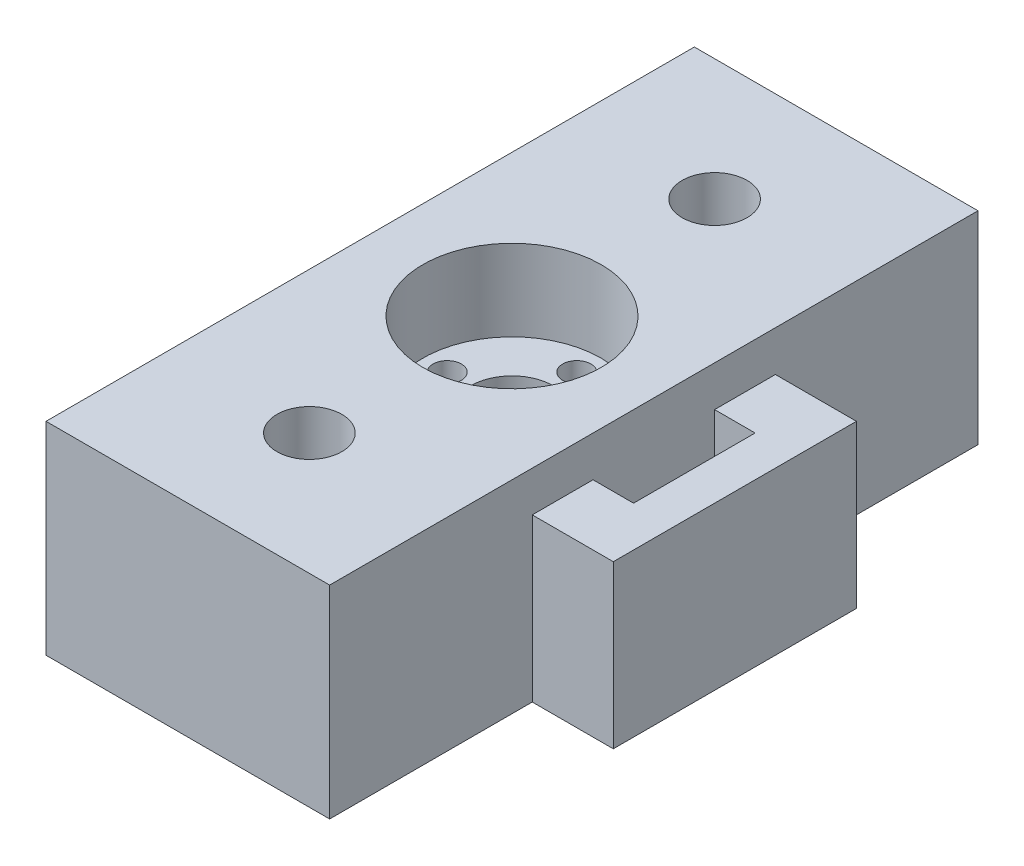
from build123d import *

# Parameters (mm, degrees)
SKETCH1_W           = 80
SKETCH1_H           = 25
BOSS_EXTRUDE1_DEPTH = 35
SKETCH2_3_R         = 11
SKETCH2_3_R_2       = 5.1
CUT_EXTRUDE2_DEPTH  = 10
SKETCH2_R           = 5.1
CUT_EXTRUDE3_DEPTH  = 91.829510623
SKETCH5_R           = 4
CUT_EXTRUDE4_DEPTH  = 91.829510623
SKETCH6_R           = 1.75
CUT_EXTRUDE5_DEPTH  = 10
SKETCH7_W           = 7.5
SKETCH7_H           = 20
BOSS_EXTRUDE2_DEPTH = 10
BOSS_EXTRUDE3_START = 10
SKETCH7_3_W         = 15
SKETCH7_3_H         = 20
BOSS_EXTRUDE3_DEPTH = 5


with BuildPart() as part:
    # Sketch1 → Boss-Extrude1 (new body)
    with BuildSketch(Plane(origin=(0, 0, 0), x_dir=(0, 0, -1), z_dir=(1, 0, 0))):
        with Locations((-40, 12.5)):
            Rectangle(SKETCH1_W, SKETCH1_H)
    extrude(amount=BOSS_EXTRUDE1_DEPTH)

    # Sketch2_3 → Cut-Extrude2 (cut)
    with BuildSketch(Plane(origin=(0, 25, 0), x_dir=(1, 0, 0), z_dir=(0, 1, 0))):
        with Locations(Location((17.5, -40, 0), (0, 0, 90))):
            Circle(SKETCH2_3_R)
        with Locations(Location((17.5, -40, 0), (0, 0, 90))):
            Circle(SKETCH2_3_R_2, mode=Mode.SUBTRACT)
    extrude(amount=-CUT_EXTRUDE2_DEPTH, mode=Mode.SUBTRACT)

    # Sketch2 → Cut-Extrude3 (cut, through all)
    with BuildSketch(Plane(origin=(0, 25, 0), x_dir=(1, 0, 0), z_dir=(0, 1, 0))):
        with Locations(Location((17.5, -40, 0), (0, 0, 270))):
            Circle(SKETCH2_R)
    extrude(amount=-CUT_EXTRUDE3_DEPTH, mode=Mode.SUBTRACT)

    # Sketch5 → Cut-Extrude4 (cut, through all)
    with BuildSketch(Plane(origin=(0, 25, 0), x_dir=(1, 0, 0), z_dir=(0, 1, 0))):
        with Locations(Location((17.5, -15, 0), (0, 0, 270))):
            Circle(SKETCH5_R)
        with Locations(Location((17.5, -65, 0), (0, 0, 270))):
            Circle(SKETCH5_R)
    extrude(amount=-CUT_EXTRUDE4_DEPTH, mode=Mode.SUBTRACT)

    # Sketch6 → Cut-Extrude5 (cut)
    with BuildSketch(Plane(origin=(0, 15, 0), x_dir=(1, 0, 0), z_dir=(0, 1, 0))):
        with Locations(Location((17.5, -32, 0), (0, 0, 270))):
            Circle(SKETCH6_R)
        with Locations(Location((25.5, -40, 0), (0, 0, 270))):
            Circle(SKETCH6_R)
        with Locations(Location((17.5, -48, 0), (0, 0, 270))):
            Circle(SKETCH6_R)
        with Locations(Location((9.5, -40, 0), (0, 0, 270))):
            Circle(SKETCH6_R)
    extrude(amount=-CUT_EXTRUDE5_DEPTH, mode=Mode.SUBTRACT)

    # Sketch7 → Boss-Extrude2 (add)
    with BuildSketch(Plane(origin=(35, 0, 0), x_dir=(0, 0, -1), z_dir=(1, 0, 0))):
        with Locations((-51.25, 10)):
            Rectangle(SKETCH7_W, SKETCH7_H)
        with Locations((-28.75, 10)):
            Rectangle(SKETCH7_W, SKETCH7_H)
    extrude(amount=BOSS_EXTRUDE2_DEPTH)

    # Sketch7_3 → Boss-Extrude3 (add)
    with BuildSketch(Plane(origin=(35, 0, 0), x_dir=(0, 0, -1), z_dir=(1, 0, 0)).offset(BOSS_EXTRUDE3_START)):
        with Locations((-40, 10)):
            Rectangle(SKETCH7_3_W, SKETCH7_3_H)
    extrude(amount=-BOSS_EXTRUDE3_DEPTH)


solid = part.part
